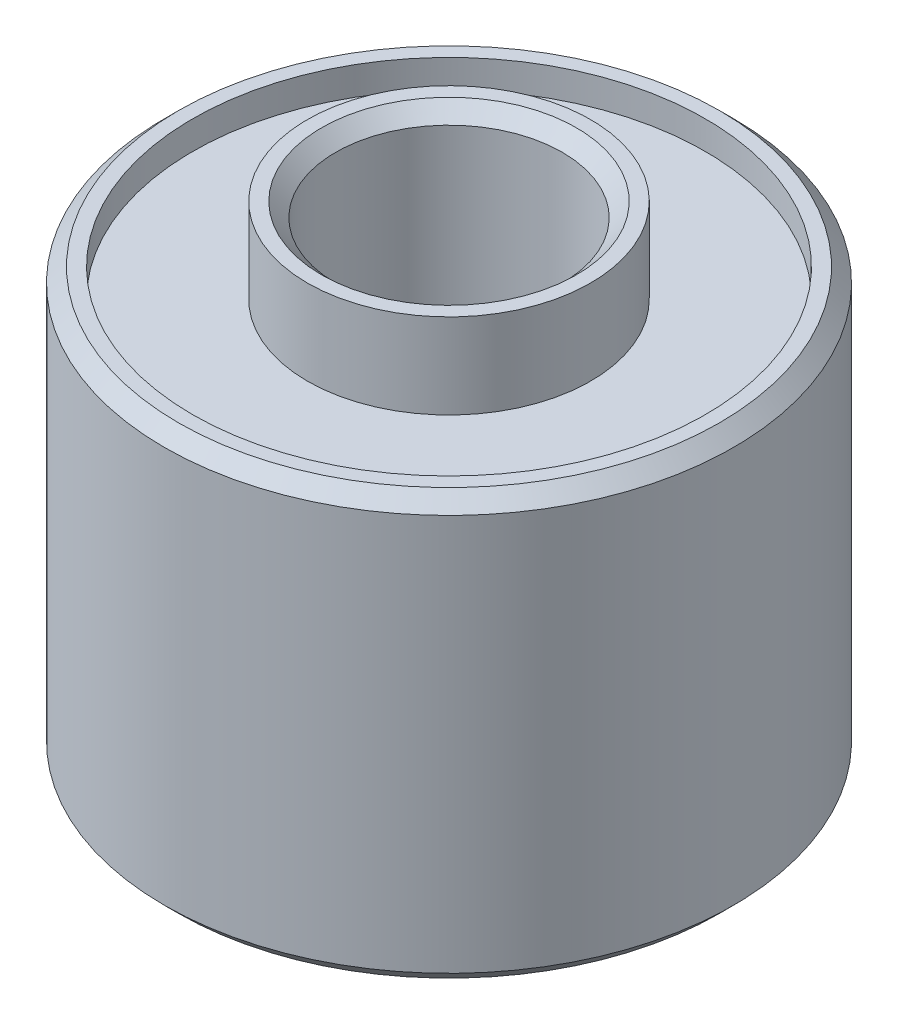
from build123d import *


with BuildPart() as part:
    # Esquisse1 → Base-R_volution (revolve)
    with BuildSketch(Plane.XY, mode=Mode.PRIVATE) as base_r_volution_sk:
        Polygon((-4, 9), (-4, -9), (-4.5, -9.5), (-5, -9.5), (-5, -6.5), (-9.05, -6.5), (-9.05, -7.5), (-9.55, -7.5), (-10.05, -7), (-10.05, 7), (-9.55, 7.5), (-9.05, 7.5), (-9.05, 6.5), (-5, 6.5), (-5, 9.5), (-4.5, 9.5), align=None)
    revolve(base_r_volution_sk.sketch.rotate(Axis((0, 0, 0), (0, -1, 0)), 270), axis=Axis((0, 0, 0), (0, -1, 0)))


solid = part.part
